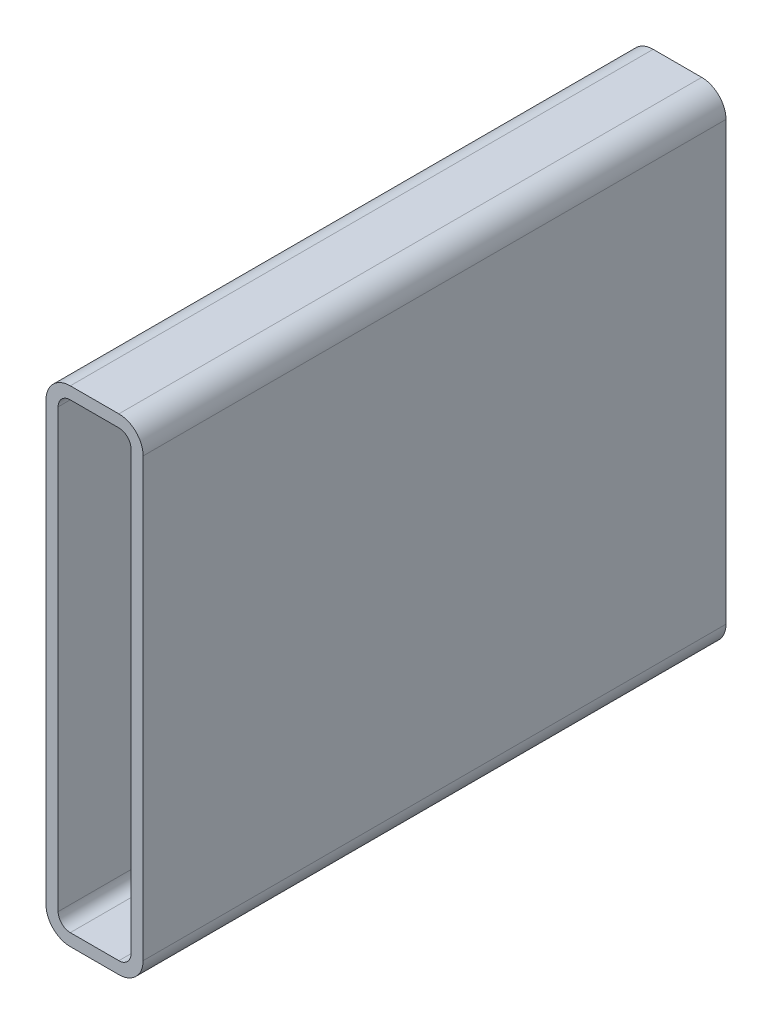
from build123d import *

# Parameters (mm, degrees)
BOSS_EXTRUDE1_DEPTH = 304.8


with BuildPart() as part:
    # Sketch1 → Boss-Extrude1 (new body)
    with BuildSketch(Plane.XY):
        with BuildLine():
            Line((12.7, 254), (38.1, 254))
            ThreePointArc((38.1, 254), (47.080256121, 250.280256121), (50.8, 241.3))
            Line((50.8, 241.3), (50.8, 12.7))
            ThreePointArc((50.8, 12.7), (47.080256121, 3.719743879), (38.1, 0))
            Line((38.1, 0), (12.7, 0))
            ThreePointArc((12.7, 0), (3.719743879, 3.719743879), (0, 12.7))
            Line((0, 12.7), (0, 241.3))
            ThreePointArc((0, 241.3), (3.719743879, 250.280256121), (12.7, 254))
        make_face()
        with BuildLine():
            Line((12.7, 247.65), (38.1, 247.65))
            ThreePointArc((38.1, 247.65), (42.590128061, 245.790128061), (44.45, 241.3))
            Line((44.45, 241.3), (44.45, 12.7))
            ThreePointArc((44.45, 12.7), (42.590128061, 8.209871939), (38.1, 6.35))
            Line((38.1, 6.35), (12.7, 6.35))
            ThreePointArc((12.7, 6.35), (8.209871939, 8.209871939), (6.35, 12.7))
            Line((6.35, 12.7), (6.35, 241.3))
            ThreePointArc((6.35, 241.3), (8.209871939, 245.790128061), (12.7, 247.65))
        make_face(mode=Mode.SUBTRACT)
    extrude(amount=BOSS_EXTRUDE1_DEPTH)


solid = part.part
